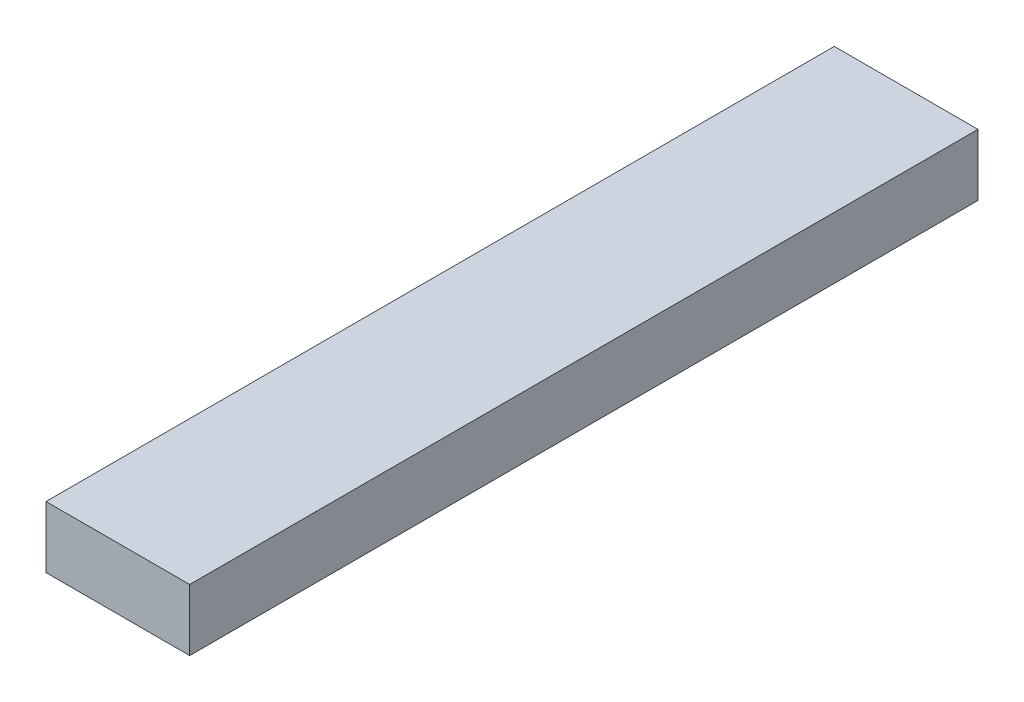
ISO-10303-21;
HEADER;
FILE_DESCRIPTION(('STEP AP214'),'2;1');
FILE_NAME('part.step','',(''),(''),'','','');
FILE_SCHEMA(('AUTOMOTIVE_DESIGN { 1 0 10303 214 1 1 1 1 }'));
ENDSEC;
DATA;
#1=APPLICATION_CONTEXT('core data for automotive mechanical design processes');
#2=APPLICATION_PROTOCOL_DEFINITION('international standard','automotive_design',2000,#1);
#3=PRODUCT_CONTEXT('',#1,'mechanical');
#4=PRODUCT('Part','Part','',(#3));
#5=PRODUCT_RELATED_PRODUCT_CATEGORY('part','',(#4));
#6=PRODUCT_DEFINITION_FORMATION('','',#4);
#7=PRODUCT_DEFINITION_CONTEXT('part definition',#1,'design');
#8=PRODUCT_DEFINITION('design','',#6,#7);
#9=PRODUCT_DEFINITION_SHAPE('','',#8);
#10=(LENGTH_UNIT() NAMED_UNIT(*) SI_UNIT(.MILLI.,.METRE.));
#11=(NAMED_UNIT(*) PLANE_ANGLE_UNIT() SI_UNIT($,.RADIAN.));
#12=(NAMED_UNIT(*) SI_UNIT($,.STERADIAN.) SOLID_ANGLE_UNIT());
#13=UNCERTAINTY_MEASURE_WITH_UNIT(LENGTH_MEASURE(1.E-05),#10,'distance_accuracy_value','');
#14=(GEOMETRIC_REPRESENTATION_CONTEXT(3) GLOBAL_UNCERTAINTY_ASSIGNED_CONTEXT((#13)) GLOBAL_UNIT_ASSIGNED_CONTEXT((#10,
#11,#12)) REPRESENTATION_CONTEXT('',''));
#15=CARTESIAN_POINT('',(0.,0.,0.));
#16=DIRECTION('',(0.,0.,1.));
#17=DIRECTION('',(1.,0.,0.));
#18=AXIS2_PLACEMENT_3D('',#15,#16,#17);
#19=CARTESIAN_POINT('',(35.,7.5,-96.));
#20=DIRECTION('',(0.,-1.,0.));
#21=DIRECTION('',(0.,0.,-1.));
#22=AXIS2_PLACEMENT_3D('',#19,#20,#21);
#23=PLANE('',#22);
#24=DIRECTION('',(0.,0.,1.));
#25=VECTOR('',#24,1.);
#26=CARTESIAN_POINT('',(0.,7.5,-96.));
#27=LINE('',#26,#25);
#28=CARTESIAN_POINT('',(0.,7.5,-96.));
#29=VERTEX_POINT('',#28);
#30=CARTESIAN_POINT('',(0.,7.5,96.));
#31=VERTEX_POINT('',#30);
#32=EDGE_CURVE('E105',#29,#31,#27,.T.);
#33=ORIENTED_EDGE('',*,*,#32,.T.);
#34=DIRECTION('',(-1.,0.,0.));
#35=VECTOR('',#34,1.);
#36=CARTESIAN_POINT('',(35.,7.5,96.));
#37=LINE('',#36,#35);
#38=CARTESIAN_POINT('',(35.,7.5,96.));
#39=VERTEX_POINT('',#38);
#40=EDGE_CURVE('E11',#39,#31,#37,.T.);
#41=ORIENTED_EDGE('',*,*,#40,.F.);
#42=DIRECTION('',(0.,0.,1.));
#43=VECTOR('',#42,1.);
#44=CARTESIAN_POINT('',(35.,7.5,-96.));
#45=LINE('',#44,#43);
#46=CARTESIAN_POINT('',(35.,7.5,-96.));
#47=VERTEX_POINT('',#46);
#48=EDGE_CURVE('E89',#47,#39,#45,.T.);
#49=ORIENTED_EDGE('',*,*,#48,.F.);
#50=DIRECTION('',(-1.,0.,0.));
#51=VECTOR('',#50,1.);
#52=CARTESIAN_POINT('',(35.,7.5,-96.));
#53=LINE('',#52,#51);
#54=EDGE_CURVE('E98',#47,#29,#53,.T.);
#55=ORIENTED_EDGE('',*,*,#54,.T.);
#56=EDGE_LOOP('',(#33,#41,#49,#55));
#57=FACE_BOUND('',#56,.T.);
#58=ADVANCED_FACE('F39',(#57),#23,.F.);
#59=CARTESIAN_POINT('',(35.,-7.5,96.));
#60=DIRECTION('',(0.,0.,-1.));
#61=DIRECTION('',(-1.,0.,0.));
#62=AXIS2_PLACEMENT_3D('',#59,#60,#61);
#63=PLANE('',#62);
#64=DIRECTION('',(0.,-1.,0.));
#65=VECTOR('',#64,1.);
#66=CARTESIAN_POINT('',(0.,-7.5,96.));
#67=LINE('',#66,#65);
#68=CARTESIAN_POINT('',(0.,-7.5,96.));
#69=VERTEX_POINT('',#68);
#70=EDGE_CURVE('E94',#31,#69,#67,.T.);
#71=ORIENTED_EDGE('',*,*,#70,.T.);
#72=DIRECTION('',(-1.,0.,0.));
#73=VECTOR('',#72,1.);
#74=CARTESIAN_POINT('',(35.,-7.5,96.));
#75=LINE('',#74,#73);
#76=CARTESIAN_POINT('',(35.,-7.5,96.));
#77=VERTEX_POINT('',#76);
#78=EDGE_CURVE('E50',#77,#69,#75,.T.);
#79=ORIENTED_EDGE('',*,*,#78,.F.);
#80=DIRECTION('',(0.,-1.,0.));
#81=VECTOR('',#80,1.);
#82=CARTESIAN_POINT('',(35.,-7.5,96.));
#83=LINE('',#82,#81);
#84=EDGE_CURVE('E84',#39,#77,#83,.T.);
#85=ORIENTED_EDGE('',*,*,#84,.F.);
#86=ORIENTED_EDGE('',*,*,#40,.T.);
#87=EDGE_LOOP('',(#71,#79,#85,#86));
#88=FACE_BOUND('',#87,.T.);
#89=ADVANCED_FACE('F91',(#88),#63,.F.);
#90=CARTESIAN_POINT('',(35.,-7.5,-96.));
#91=DIRECTION('',(0.,1.,0.));
#92=DIRECTION('',(0.,0.,1.));
#93=AXIS2_PLACEMENT_3D('',#90,#91,#92);
#94=PLANE('',#93);
#95=DIRECTION('',(0.,0.,-1.));
#96=VECTOR('',#95,1.);
#97=CARTESIAN_POINT('',(0.,-7.5,-96.));
#98=LINE('',#97,#96);
#99=CARTESIAN_POINT('',(0.,-7.5,-96.));
#100=VERTEX_POINT('',#99);
#101=EDGE_CURVE('E75',#69,#100,#98,.T.);
#102=ORIENTED_EDGE('',*,*,#101,.T.);
#103=DIRECTION('',(-1.,0.,0.));
#104=VECTOR('',#103,1.);
#105=CARTESIAN_POINT('',(35.,-7.5,-96.));
#106=LINE('',#105,#104);
#107=CARTESIAN_POINT('',(35.,-7.5,-96.));
#108=VERTEX_POINT('',#107);
#109=EDGE_CURVE('E92',#108,#100,#106,.T.);
#110=ORIENTED_EDGE('',*,*,#109,.F.);
#111=DIRECTION('',(0.,0.,-1.));
#112=VECTOR('',#111,1.);
#113=CARTESIAN_POINT('',(35.,-7.5,-96.));
#114=LINE('',#113,#112);
#115=EDGE_CURVE('E86',#77,#108,#114,.T.);
#116=ORIENTED_EDGE('',*,*,#115,.F.);
#117=ORIENTED_EDGE('',*,*,#78,.T.);
#118=EDGE_LOOP('',(#102,#110,#116,#117));
#119=FACE_BOUND('',#118,.T.);
#120=ADVANCED_FACE('F96',(#119),#94,.F.);
#121=CARTESIAN_POINT('',(35.,-7.5,-96.));
#122=DIRECTION('',(0.,0.,1.));
#123=DIRECTION('',(1.,0.,0.));
#124=AXIS2_PLACEMENT_3D('',#121,#122,#123);
#125=PLANE('',#124);
#126=DIRECTION('',(0.,1.,0.));
#127=VECTOR('',#126,1.);
#128=CARTESIAN_POINT('',(0.,-7.5,-96.));
#129=LINE('',#128,#127);
#130=EDGE_CURVE('E79',#100,#29,#129,.T.);
#131=ORIENTED_EDGE('',*,*,#130,.T.);
#132=ORIENTED_EDGE('',*,*,#54,.F.);
#133=DIRECTION('',(0.,1.,0.));
#134=VECTOR('',#133,1.);
#135=CARTESIAN_POINT('',(35.,-7.5,-96.));
#136=LINE('',#135,#134);
#137=EDGE_CURVE('E54',#108,#47,#136,.T.);
#138=ORIENTED_EDGE('',*,*,#137,.F.);
#139=ORIENTED_EDGE('',*,*,#109,.T.);
#140=EDGE_LOOP('',(#131,#132,#138,#139));
#141=FACE_BOUND('',#140,.T.);
#142=ADVANCED_FACE('F108',(#141),#125,.F.);
#143=CARTESIAN_POINT('',(35.,0.,0.));
#144=DIRECTION('',(-1.,0.,0.));
#145=DIRECTION('',(0.,0.,1.));
#146=AXIS2_PLACEMENT_3D('',#143,#144,#145);
#147=PLANE('',#146);
#148=ORIENTED_EDGE('',*,*,#48,.T.);
#149=ORIENTED_EDGE('',*,*,#84,.T.);
#150=ORIENTED_EDGE('',*,*,#115,.T.);
#151=ORIENTED_EDGE('',*,*,#137,.T.);
#152=EDGE_LOOP('',(#148,#149,#150,#151));
#153=FACE_BOUND('',#152,.T.);
#154=ADVANCED_FACE('F88',(#153),#147,.F.);
#155=CARTESIAN_POINT('',(0.,0.,0.));
#156=DIRECTION('',(-1.,0.,0.));
#157=DIRECTION('',(0.,0.,1.));
#158=AXIS2_PLACEMENT_3D('',#155,#156,#157);
#159=PLANE('',#158);
#160=ORIENTED_EDGE('',*,*,#32,.F.);
#161=ORIENTED_EDGE('',*,*,#130,.F.);
#162=ORIENTED_EDGE('',*,*,#101,.F.);
#163=ORIENTED_EDGE('',*,*,#70,.F.);
#164=EDGE_LOOP('',(#160,#161,#162,#163));
#165=FACE_BOUND('',#164,.T.);
#166=ADVANCED_FACE('F115',(#165),#159,.T.);
#167=CLOSED_SHELL('',(#58,#89,#120,#142,#154,#166));
#168=MANIFOLD_SOLID_BREP('B2',#167);
#169=ADVANCED_BREP_SHAPE_REPRESENTATION('',(#18,#168),#14);
#170=SHAPE_DEFINITION_REPRESENTATION(#9,#169);
ENDSEC;
END-ISO-10303-21;
